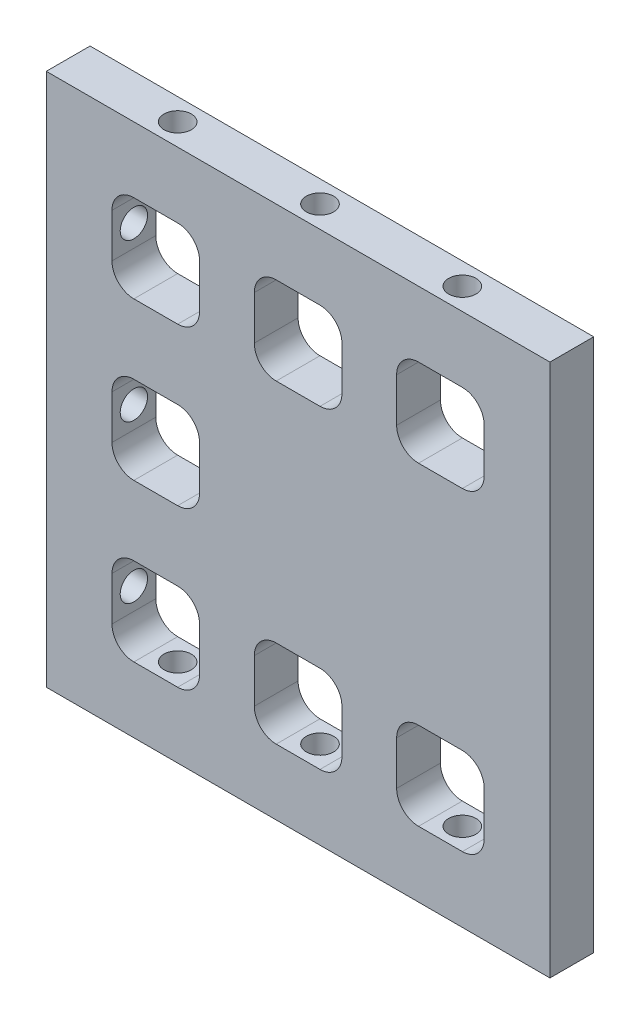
from build123d import *

# Parameters (mm, degrees)
BASE_EXTRUDE_DEPTH      = 6.35
BASE_EXTRUDE_DEPTH_BACK = 6.35
SKETCH1_W               = 66.04
SKETCH1_H               = 154.686
CUT_EXTRUDE1_DEPTH      = 87.902249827
SKETCH3_R               = 3.9624
CUT_EXTRUDE3_DEPTH      = 22.86
SKETCH4_R               = 3.9624
CUT_EXTRUDE4_DEPTH      = 22.86
CUT_EXTRUDE5_START      = -22.86
SKETCH5_R               = 3.9624
CUT_EXTRUDE5_DEPTH      = 22.86
SKETCH6_W               = 94.039157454
SKETCH6_H               = 154.686
EXTRUDE1_DEPTH          = 12.7
CUT_EXTRUDE8_DEPTH      = 139.699176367
SKETCH10_R              = 3.9624
CUT_EXTRUDE9_DEPTH      = 27.78
CUT_EXTRUDE10_START     = -27.78
SKETCH11_R              = 3.9624
CUT_EXTRUDE10_DEPTH     = 27.78
SKETCH7_R               = 3.9624
CUT_EXTRUDE11_DEPTH     = 22.86
CUT_EXTRUDE12_START     = -22.86
SKETCH8_R               = 3.9624
CUT_EXTRUDE12_DEPTH     = 22.86


with BuildPart() as part:
    # Sketch1 → Base-Extrude (new, two sides: drawn at the far end of the back side and taken through both)
    with BuildSketch(Plane.XY.offset(-BASE_EXTRUDE_DEPTH_BACK)):
        with Locations((0, -2.032)):
            Rectangle(SKETCH1_W, SKETCH1_H)
    extrude(amount=BASE_EXTRUDE_DEPTH + BASE_EXTRUDE_DEPTH_BACK)

    # Sketch2 → Cut-Extrude1 (cut, through all)
    with BuildSketch(Plane.XY.offset(6.35)):
        with BuildLine():
            Line((-7.62, 56.261), (5.08, 56.261))
            ThreePointArc((5.08, 56.261), (9.570128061, 54.401128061), (11.43, 49.911))
            Line((11.43, 49.911), (11.43, 37.211))
            ThreePointArc((11.43, 37.211), (9.570128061, 32.720871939), (5.08, 30.861))
            Line((5.08, 30.861), (-7.62, 30.861))
            ThreePointArc((-7.62, 30.861), (-12.110128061, 32.720871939), (-13.97, 37.211))
            Line((-13.97, 37.211), (-13.97, 49.911))
            ThreePointArc((-13.97, 49.911), (-12.110128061, 54.401128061), (-7.62, 56.261))
        make_face()
        with BuildLine():
            Line((-7.62, -60.325), (5.08, -60.325))
            ThreePointArc((5.08, -60.325), (9.570128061, -58.465128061), (11.43, -53.975))
            Line((11.43, -53.975), (11.43, -41.275))
            ThreePointArc((11.43, -41.275), (9.570128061, -36.784871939), (5.08, -34.925))
            Line((5.08, -34.925), (-7.62, -34.925))
            ThreePointArc((-7.62, -34.925), (-12.110128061, -36.784871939), (-13.97, -41.275))
            Line((-13.97, -41.275), (-13.97, -53.975))
            ThreePointArc((-13.97, -53.975), (-12.110128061, -58.465128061), (-7.62, -60.325))
        make_face()
        with BuildLine():
            Line((-7.62, 10.668), (5.08, 10.668))
            ThreePointArc((5.08, 10.668), (9.570128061, 8.808128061), (11.43, 4.318))
            Line((11.43, 4.318), (11.43, -8.382))
            ThreePointArc((11.43, -8.382), (9.570128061, -12.872128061), (5.08, -14.732))
            Line((5.08, -14.732), (-7.62, -14.732))
            ThreePointArc((-7.62, -14.732), (-12.110128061, -12.872128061), (-13.97, -8.382))
            Line((-13.97, -8.382), (-13.97, 4.318))
            ThreePointArc((-13.97, 4.318), (-12.110128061, 8.808128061), (-7.62, 10.668))
        make_face()
    extrude(amount=-CUT_EXTRUDE1_DEPTH, mode=Mode.SUBTRACT)

    # Sketch3 → Cut-Extrude3 (cut)
    with BuildSketch(Plane.ZY.offset(33.02)):
        with Locations(Location((0, -47.625, 0), (0, 0, 270))):
            Circle(SKETCH3_R)
        with Locations(Location((0, -2.032, 0), (0, 0, 270))):
            Circle(SKETCH3_R)
        with Locations(Location((0, 43.561, 0), (0, 0, 270))):
            Circle(SKETCH3_R)
    extrude(amount=-CUT_EXTRUDE3_DEPTH, mode=Mode.SUBTRACT)

    # Sketch4 → Cut-Extrude4 (cut)
    with BuildSketch(Plane(origin=(0, 75.311, 0), x_dir=(-1, 0, 0), z_dir=(0, 1, 0))):
        with Locations((1.27, 0)):
            Circle(SKETCH4_R)
    extrude(amount=-CUT_EXTRUDE4_DEPTH, mode=Mode.SUBTRACT)

    # Sketch5 → Cut-Extrude5 (cut)
    with BuildSketch(Plane.XZ.offset(79.375).offset(CUT_EXTRUDE5_START)):
        with Locations(Location((-1.27, 0, 0), (0, 0, 180))):
            Circle(SKETCH5_R)
    extrude(amount=CUT_EXTRUDE5_DEPTH, mode=Mode.SUBTRACT)

    # Sketch6 → Extrude1 (add)
    with BuildSketch(Plane.XY.offset(6.35)):
        with Locations((66.010421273, -2.032)):
            Rectangle(SKETCH6_W, SKETCH6_H)
        with BuildLine():
            Line((33.655, 30.861), (46.355, 30.861))
            ThreePointArc((46.355, 30.861), (50.845128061, 32.720871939), (52.705, 37.211))
            Line((52.705, 37.211), (52.705, 49.911))
            ThreePointArc((52.705, 49.911), (50.845128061, 54.401128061), (46.355, 56.261))
            Line((46.355, 56.261), (33.655, 56.261))
            ThreePointArc((33.655, 56.261), (29.164871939, 54.401128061), (27.305, 49.911))
            Line((27.305, 49.911), (27.305, 37.211))
            ThreePointArc((27.305, 37.211), (29.164871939, 32.720871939), (33.655, 30.861))
        make_face(mode=Mode.SUBTRACT)
        with BuildLine():
            Line((52.705, -41.275), (52.705, -53.975))
            ThreePointArc((52.705, -53.975), (50.845128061, -58.465128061), (46.355, -60.325))
            Line((46.355, -60.325), (33.655, -60.325))
            ThreePointArc((33.655, -60.325), (29.164871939, -58.465128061), (27.305, -53.975))
            Line((27.305, -53.975), (27.305, -41.275))
            ThreePointArc((27.305, -41.275), (29.164871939, -36.784871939), (33.655, -34.925))
            Line((33.655, -34.925), (46.355, -34.925))
            ThreePointArc((46.355, -34.925), (50.845128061, -36.784871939), (52.705, -41.275))
        make_face(mode=Mode.SUBTRACT)
        with BuildLine():
            Line((74.93, 30.861), (87.63, 30.861))
            ThreePointArc((87.63, 30.861), (92.120128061, 32.720871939), (93.98, 37.211))
            Line((93.98, 37.211), (93.98, 49.911))
            ThreePointArc((93.98, 49.911), (92.120128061, 54.401128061), (87.63, 56.261))
            Line((87.63, 56.261), (74.93, 56.261))
            ThreePointArc((74.93, 56.261), (70.439871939, 54.401128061), (68.58, 49.911))
            Line((68.58, 49.911), (68.58, 37.211))
            ThreePointArc((68.58, 37.211), (70.439871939, 32.720871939), (74.93, 30.861))
        make_face(mode=Mode.SUBTRACT)
        with BuildLine():
            Line((93.98, -41.275), (93.98, -53.975))
            ThreePointArc((93.98, -53.975), (92.120128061, -58.465128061), (87.63, -60.325))
            Line((87.63, -60.325), (74.93, -60.325))
            ThreePointArc((74.93, -60.325), (70.439871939, -58.465128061), (68.58, -53.975))
            Line((68.58, -53.975), (68.58, -41.275))
            ThreePointArc((68.58, -41.275), (70.439871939, -36.784871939), (74.93, -34.925))
            Line((74.93, -34.925), (87.63, -34.925))
            ThreePointArc((87.63, -34.925), (92.120128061, -36.784871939), (93.98, -41.275))
        make_face(mode=Mode.SUBTRACT)
    extrude(amount=-EXTRUDE1_DEPTH)

    # Sketch9 → Cut-Extrude8 (cut, through all)
    with BuildSketch(Plane.XY.offset(6.35)):
        with BuildLine():
            Line((27.305, -41.275), (27.305, -53.975))
            ThreePointArc((27.305, -53.975), (28.945713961, -58.234709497), (33.02, -60.293170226))
            Line((33.02, -60.293170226), (33.02, -34.956829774))
            ThreePointArc((33.02, -34.956829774), (28.945713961, -37.015290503), (27.305, -41.275))
        make_face()
        with BuildLine():
            Line((27.305, 49.911), (27.305, 37.211))
            ThreePointArc((27.305, 37.211), (28.945713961, 32.951290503), (33.02, 30.892829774))
            Line((33.02, 30.892829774), (33.02, 56.229170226))
            ThreePointArc((33.02, 56.229170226), (28.945713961, 54.170709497), (27.305, 49.911))
        make_face()
    extrude(amount=-CUT_EXTRUDE8_DEPTH, mode=Mode.SUBTRACT)

    # Sketch10 → Cut-Extrude9 (cut)
    with BuildSketch(Plane(origin=(0, 75.311, 0), x_dir=(-1, 0, 0), z_dir=(0, 1, 0))):
        with Locations((-81.28, 0)):
            Circle(SKETCH10_R)
    extrude(amount=-CUT_EXTRUDE9_DEPTH, mode=Mode.SUBTRACT)

    # Sketch11 → Cut-Extrude10 (cut)
    with BuildSketch(Plane.XZ.offset(79.375).offset(CUT_EXTRUDE10_START)):
        with Locations(Location((81.28, 0, 0), (0, 0, 180))):
            Circle(SKETCH11_R)
    extrude(amount=CUT_EXTRUDE10_DEPTH, mode=Mode.SUBTRACT)

    # Sketch7 → Cut-Extrude11 (cut)
    with BuildSketch(Plane(origin=(0, 75.311, 0), x_dir=(-1, 0, 0), z_dir=(0, 1, 0))):
        with Locations((-40.005, 0)):
            Circle(SKETCH7_R)
    extrude(amount=-CUT_EXTRUDE11_DEPTH, mode=Mode.SUBTRACT)

    # Sketch8 → Cut-Extrude12 (cut)
    with BuildSketch(Plane.XZ.offset(79.375).offset(CUT_EXTRUDE12_START)):
        with Locations(Location((40.005, 0, 0), (0, 0, 180))):
            Circle(SKETCH8_R)
    extrude(amount=CUT_EXTRUDE12_DEPTH, mode=Mode.SUBTRACT)


solid = part.part
